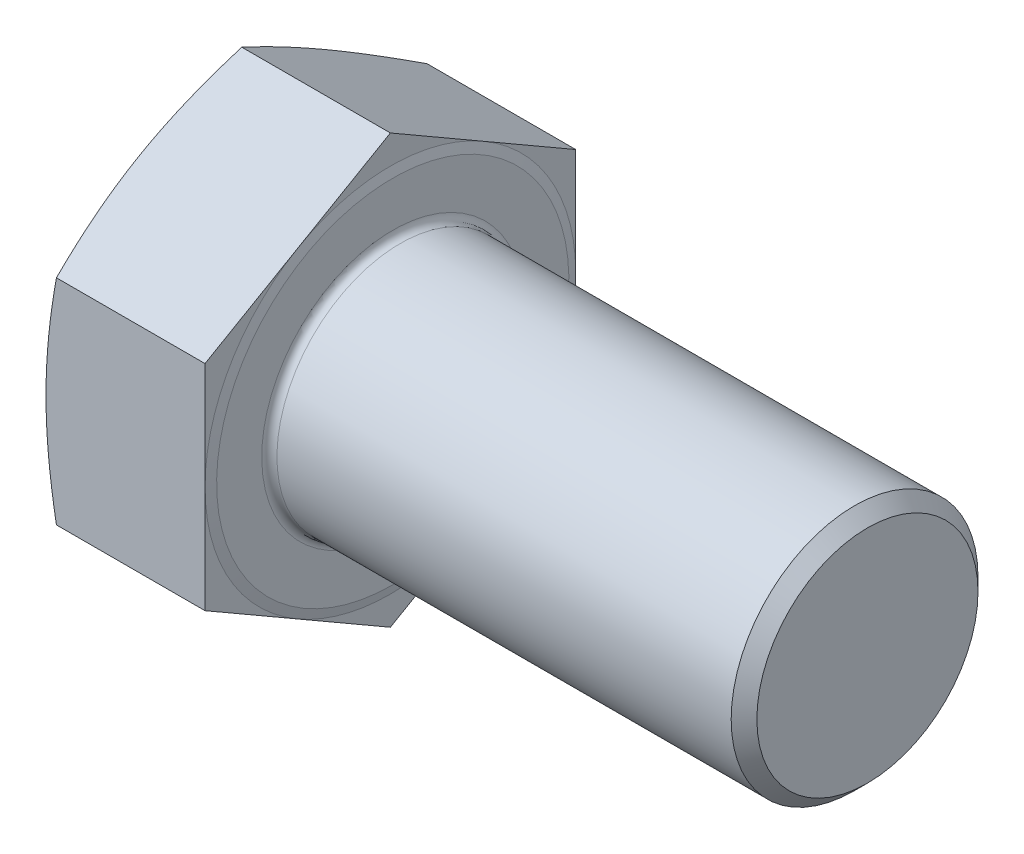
ISO-10303-21;
HEADER;
FILE_DESCRIPTION(('STEP AP214'),'2;1');
FILE_NAME('part.step','',(''),(''),'','','');
FILE_SCHEMA(('AUTOMOTIVE_DESIGN { 1 0 10303 214 1 1 1 1 }'));
ENDSEC;
DATA;
#1=APPLICATION_CONTEXT('core data for automotive mechanical design processes');
#2=APPLICATION_PROTOCOL_DEFINITION('international standard','automotive_design',2000,#1);
#3=PRODUCT_CONTEXT('',#1,'mechanical');
#4=PRODUCT('Part','Part','',(#3));
#5=PRODUCT_RELATED_PRODUCT_CATEGORY('part','',(#4));
#6=PRODUCT_DEFINITION_FORMATION('','',#4);
#7=PRODUCT_DEFINITION_CONTEXT('part definition',#1,'design');
#8=PRODUCT_DEFINITION('design','',#6,#7);
#9=PRODUCT_DEFINITION_SHAPE('','',#8);
#10=(LENGTH_UNIT() NAMED_UNIT(*) SI_UNIT(.MILLI.,.METRE.));
#11=(NAMED_UNIT(*) PLANE_ANGLE_UNIT() SI_UNIT($,.RADIAN.));
#12=(NAMED_UNIT(*) SI_UNIT($,.STERADIAN.) SOLID_ANGLE_UNIT());
#13=UNCERTAINTY_MEASURE_WITH_UNIT(LENGTH_MEASURE(1.E-05),#10,'distance_accuracy_value','');
#14=(GEOMETRIC_REPRESENTATION_CONTEXT(3) GLOBAL_UNCERTAINTY_ASSIGNED_CONTEXT((#13)) GLOBAL_UNIT_ASSIGNED_CONTEXT((#10,
#11,#12)) REPRESENTATION_CONTEXT('',''));
#15=CARTESIAN_POINT('',(0.,0.,0.));
#16=DIRECTION('',(0.,0.,1.));
#17=DIRECTION('',(1.,0.,0.));
#18=AXIS2_PLACEMENT_3D('',#15,#16,#17);
#19=CARTESIAN_POINT('',(34.,0.,0.));
#20=DIRECTION('',(-1.,0.,0.));
#21=DIRECTION('',(0.,-1.,0.));
#22=AXIS2_PLACEMENT_3D('',#19,#20,#21);
#23=PLANE('',#22);
#24=CARTESIAN_POINT('',(34.,0.,0.));
#25=DIRECTION('',(-1.,0.,0.));
#26=DIRECTION('',(0.,-1.,0.));
#27=AXIS2_PLACEMENT_3D('',#24,#25,#26);
#28=CIRCLE('',#27,27.6);
#29=CARTESIAN_POINT('',(34.,-27.6,0.));
#30=VERTEX_POINT('',#29);
#31=EDGE_CURVE('E11',#30,#30,#28,.T.);
#32=ORIENTED_EDGE('',*,*,#31,.T.);
#33=EDGE_LOOP('',(#32));
#34=FACE_BOUND('',#33,.T.);
#35=CARTESIAN_POINT('',(34.,0.,0.));
#36=DIRECTION('',(-1.,0.,0.));
#37=DIRECTION('',(0.,-1.,0.));
#38=AXIS2_PLACEMENT_3D('',#35,#36,#37);
#39=CIRCLE('',#38,37.1);
#40=CARTESIAN_POINT('',(34.,-37.1,0.));
#41=VERTEX_POINT('',#40);
#42=EDGE_CURVE('E140',#41,#41,#39,.T.);
#43=ORIENTED_EDGE('',*,*,#42,.F.);
#44=EDGE_LOOP('',(#43));
#45=FACE_BOUND('',#44,.T.);
#46=ADVANCED_FACE('F32',(#34,#45),#23,.F.);
#47=CARTESIAN_POINT('',(33.5,0.,78.1));
#48=DIRECTION('',(-1.,0.,0.));
#49=DIRECTION('',(0.,0.,1.));
#50=AXIS2_PLACEMENT_3D('',#47,#48,#49);
#51=PLANE('',#50);
#52=DIRECTION('',(0.,-0.5,-0.866025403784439));
#53=VECTOR('',#52,1.);
#54=CARTESIAN_POINT('',(33.5,-22.5455280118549,39.05));
#55=LINE('',#54,#53);
#56=CARTESIAN_POINT('',(33.5,-22.5455280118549,39.05));
#57=VERTEX_POINT('',#56);
#58=CARTESIAN_POINT('',(33.5,-33.8182920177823,19.525));
#59=VERTEX_POINT('',#58);
#60=EDGE_CURVE('E139',#57,#59,#55,.T.);
#61=ORIENTED_EDGE('',*,*,#60,.T.);
#62=CARTESIAN_POINT('',(33.5,0.,0.));
#63=DIRECTION('',(-1.,0.,0.));
#64=DIRECTION('',(0.,-1.,0.));
#65=AXIS2_PLACEMENT_3D('',#62,#63,#64);
#66=CIRCLE('',#65,39.05);
#67=CARTESIAN_POINT('',(33.5,0.,39.05));
#68=VERTEX_POINT('',#67);
#69=EDGE_CURVE('E48',#59,#68,#66,.T.);
#70=ORIENTED_EDGE('',*,*,#69,.T.);
#71=DIRECTION('',(0.,-1.,0.));
#72=VECTOR('',#71,1.);
#73=CARTESIAN_POINT('',(33.5,22.5455280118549,39.05));
#74=LINE('',#73,#72);
#75=EDGE_CURVE('E136',#68,#57,#74,.T.);
#76=ORIENTED_EDGE('',*,*,#75,.T.);
#77=EDGE_LOOP('',(#61,#70,#76));
#78=FACE_BOUND('',#77,.T.);
#79=ADVANCED_FACE('F135',(#78),#51,.F.);
#80=CARTESIAN_POINT('',(33.5,22.5455280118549,39.05));
#81=VERTEX_POINT('',#80);
#82=EDGE_CURVE('E147',#81,#68,#74,.T.);
#83=ORIENTED_EDGE('',*,*,#82,.T.);
#84=CARTESIAN_POINT('',(33.5,33.8182920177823,19.525));
#85=VERTEX_POINT('',#84);
#86=EDGE_CURVE('E122',#68,#85,#66,.T.);
#87=ORIENTED_EDGE('',*,*,#86,.T.);
#88=DIRECTION('',(0.,-0.5,0.866025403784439));
#89=VECTOR('',#88,1.);
#90=CARTESIAN_POINT('',(33.5,45.0910560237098,0.));
#91=LINE('',#90,#89);
#92=EDGE_CURVE('E153',#85,#81,#91,.T.);
#93=ORIENTED_EDGE('',*,*,#92,.T.);
#94=EDGE_LOOP('',(#83,#87,#93));
#95=FACE_BOUND('',#94,.T.);
#96=ADVANCED_FACE('F152',(#95),#51,.F.);
#97=CARTESIAN_POINT('',(33.5,45.0910560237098,0.));
#98=VERTEX_POINT('',#97);
#99=EDGE_CURVE('E150',#98,#85,#91,.T.);
#100=ORIENTED_EDGE('',*,*,#99,.T.);
#101=CARTESIAN_POINT('',(33.5,33.8182920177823,-19.525));
#102=VERTEX_POINT('',#101);
#103=EDGE_CURVE('E126',#85,#102,#66,.T.);
#104=ORIENTED_EDGE('',*,*,#103,.T.);
#105=DIRECTION('',(0.,0.5,0.866025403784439));
#106=VECTOR('',#105,1.);
#107=CARTESIAN_POINT('',(33.5,22.5455280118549,-39.05));
#108=LINE('',#107,#106);
#109=EDGE_CURVE('E309',#102,#98,#108,.T.);
#110=ORIENTED_EDGE('',*,*,#109,.T.);
#111=EDGE_LOOP('',(#100,#104,#110));
#112=FACE_BOUND('',#111,.T.);
#113=ADVANCED_FACE('F298',(#112),#51,.F.);
#114=CARTESIAN_POINT('',(33.5,22.5455280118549,-39.05));
#115=VERTEX_POINT('',#114);
#116=EDGE_CURVE('E312',#115,#102,#108,.T.);
#117=ORIENTED_EDGE('',*,*,#116,.T.);
#118=CARTESIAN_POINT('',(33.5,0.,-39.05));
#119=VERTEX_POINT('',#118);
#120=EDGE_CURVE('E371',#102,#119,#66,.T.);
#121=ORIENTED_EDGE('',*,*,#120,.T.);
#122=DIRECTION('',(0.,1.,0.));
#123=VECTOR('',#122,1.);
#124=CARTESIAN_POINT('',(33.5,-22.5455280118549,-39.05));
#125=LINE('',#124,#123);
#126=EDGE_CURVE('E310',#119,#115,#125,.T.);
#127=ORIENTED_EDGE('',*,*,#126,.T.);
#128=EDGE_LOOP('',(#117,#121,#127));
#129=FACE_BOUND('',#128,.T.);
#130=ADVANCED_FACE('F291',(#129),#51,.F.);
#131=CARTESIAN_POINT('',(33.5,-22.5455280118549,-39.05));
#132=VERTEX_POINT('',#131);
#133=EDGE_CURVE('E303',#132,#119,#125,.T.);
#134=ORIENTED_EDGE('',*,*,#133,.T.);
#135=CARTESIAN_POINT('',(33.5,-33.8182920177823,-19.525));
#136=VERTEX_POINT('',#135);
#137=EDGE_CURVE('E304',#119,#136,#66,.T.);
#138=ORIENTED_EDGE('',*,*,#137,.T.);
#139=DIRECTION('',(0.,0.5,-0.866025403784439));
#140=VECTOR('',#139,1.);
#141=CARTESIAN_POINT('',(33.5,-45.0910560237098,0.));
#142=LINE('',#141,#140);
#143=EDGE_CURVE('E306',#136,#132,#142,.T.);
#144=ORIENTED_EDGE('',*,*,#143,.T.);
#145=EDGE_LOOP('',(#134,#138,#144));
#146=FACE_BOUND('',#145,.T.);
#147=ADVANCED_FACE('F283',(#146),#51,.F.);
#148=CARTESIAN_POINT('',(33.5,-22.5455280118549,39.05));
#149=DIRECTION('',(0.,0.866025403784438,-0.5));
#150=DIRECTION('',(0.,0.5,0.866025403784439));
#151=AXIS2_PLACEMENT_3D('',#148,#149,#150);
#152=PLANE('',#151);
#153=CARTESIAN_POINT('',(2.19880660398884,-45.0911714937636,-0.000199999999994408));
#154=CARTESIAN_POINT('',(2.02887897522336,-44.6242889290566,0.808464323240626));
#155=CARTESIAN_POINT('',(1.86659855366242,-44.1566940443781,1.61836242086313));
#156=CARTESIAN_POINT('',(1.5590027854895,-43.2200682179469,3.24064593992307));
#157=CARTESIAN_POINT('',(1.41368905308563,-42.7510371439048,4.05303159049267));
#158=CARTESIAN_POINT('',(1.14162647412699,-41.8112577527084,5.68077724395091));
#159=CARTESIAN_POINT('',(1.01489188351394,-41.3405083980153,6.49613904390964));
#160=CARTESIAN_POINT('',(0.781802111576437,-40.3977578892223,8.12903082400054));
#161=CARTESIAN_POINT('',(0.6754463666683,-39.9257567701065,8.94656074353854));
#162=CARTESIAN_POINT('',(0.485579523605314,-38.9850975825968,10.5758302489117));
#163=CARTESIAN_POINT('',(0.401862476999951,-38.5164499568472,11.3875517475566));
#164=CARTESIAN_POINT('',(0.257292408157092,-37.5782666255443,13.0125329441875));
#165=CARTESIAN_POINT('',(0.196439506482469,-37.1087309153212,13.8257926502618));
#166=CARTESIAN_POINT('',(0.0986562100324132,-36.1692056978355,15.4530980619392));
#167=CARTESIAN_POINT('',(0.0617170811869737,-35.6992164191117,16.2671433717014));
#168=CARTESIAN_POINT('',(0.0123890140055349,-34.7589154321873,17.8957924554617));
#169=CARTESIAN_POINT('',(0.,-34.2886037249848,18.7103962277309));
#170=CARTESIAN_POINT('',(0.,-33.3479803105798,20.3396037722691));
#171=CARTESIAN_POINT('',(0.0123890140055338,-32.8776686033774,21.1542075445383));
#172=CARTESIAN_POINT('',(0.0617170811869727,-31.9373676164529,22.7828566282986));
#173=CARTESIAN_POINT('',(0.0986562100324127,-31.4673783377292,23.5969019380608));
#174=CARTESIAN_POINT('',(0.196439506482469,-30.5278531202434,25.2242073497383));
#175=CARTESIAN_POINT('',(0.257292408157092,-30.0583174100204,26.0374670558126));
#176=CARTESIAN_POINT('',(0.401862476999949,-29.1201340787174,27.6624482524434));
#177=CARTESIAN_POINT('',(0.48557952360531,-28.6514864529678,28.4741697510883));
#178=CARTESIAN_POINT('',(0.675446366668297,-27.7108272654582,30.1034392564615));
#179=CARTESIAN_POINT('',(0.781802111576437,-27.2388261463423,30.9209691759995));
#180=CARTESIAN_POINT('',(1.01489188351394,-26.2960756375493,32.5538609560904));
#181=CARTESIAN_POINT('',(1.14162647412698,-25.8253262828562,33.3692227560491));
#182=CARTESIAN_POINT('',(1.41368905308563,-24.8855468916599,34.9969684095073));
#183=CARTESIAN_POINT('',(1.55900278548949,-24.4165158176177,35.8093540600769));
#184=CARTESIAN_POINT('',(1.86659855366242,-23.4798899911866,37.4316375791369));
#185=CARTESIAN_POINT('',(2.02887897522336,-23.012295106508,38.2415356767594));
#186=CARTESIAN_POINT('',(2.19880660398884,-22.545412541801,39.0502));
#187=B_SPLINE_CURVE_WITH_KNOTS('',3,(#153,#154,#155,#156,#157,#158,#159,#160,#161,#162,#163,
#164,#165,#166,#167,#168,#169,#170,#171,#172,#173,#174,#175,#176,#177,#178,#179,#180,#181,#182,
#183,#184,#185,#186),.UNSPECIFIED.,.F.,.F.,(4,2,2,2,2,2,2,2,2,2,2,2,2,2,2,2,4),(0.,
2.8473194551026,5.69490958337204,8.54467338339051,11.3943583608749,14.2171733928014,
17.040003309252,19.8618016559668,22.6835913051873,25.5053809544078,28.3271793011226,
31.1500092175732,33.9728242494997,36.8225092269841,39.6722730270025,42.519863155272,
45.3671826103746),.UNSPECIFIED.);
#188=CARTESIAN_POINT('',(2.19876457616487,-45.0910560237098,0.));
#189=VERTEX_POINT('',#188);
#190=CARTESIAN_POINT('',(0.,-33.8182920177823,19.525));
#191=VERTEX_POINT('',#190);
#192=EDGE_CURVE('E352',#189,#191,#187,.T.);
#193=ORIENTED_EDGE('',*,*,#192,.F.);
#194=DIRECTION('',(-1.,0.,0.));
#195=VECTOR('',#194,1.);
#196=CARTESIAN_POINT('',(33.5,-45.0910560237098,0.));
#197=LINE('',#196,#195);
#198=CARTESIAN_POINT('',(33.5,-45.0910560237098,0.));
#199=VERTEX_POINT('',#198);
#200=EDGE_CURVE('E170',#199,#189,#197,.T.);
#201=ORIENTED_EDGE('',*,*,#200,.F.);
#202=EDGE_CURVE('E360',#59,#199,#55,.T.);
#203=ORIENTED_EDGE('',*,*,#202,.F.);
#204=ORIENTED_EDGE('',*,*,#60,.F.);
#205=DIRECTION('',(-1.,0.,0.));
#206=VECTOR('',#205,1.);
#207=CARTESIAN_POINT('',(33.5,-22.5455280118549,39.05));
#208=LINE('',#207,#206);
#209=CARTESIAN_POINT('',(2.19876457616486,-22.5455280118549,39.05));
#210=VERTEX_POINT('',#209);
#211=EDGE_CURVE('E149',#57,#210,#208,.T.);
#212=ORIENTED_EDGE('',*,*,#211,.T.);
#213=EDGE_CURVE('E240',#191,#210,#187,.T.);
#214=ORIENTED_EDGE('',*,*,#213,.F.);
#215=EDGE_LOOP('',(#193,#201,#203,#204,#212,#214));
#216=FACE_BOUND('',#215,.T.);
#217=ADVANCED_FACE('F34',(#216),#152,.F.);
#218=CARTESIAN_POINT('',(33.5,-45.0910560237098,0.));
#219=DIRECTION('',(0.,0.866025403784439,0.5));
#220=DIRECTION('',(0.,-0.5,0.866025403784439));
#221=AXIS2_PLACEMENT_3D('',#218,#219,#220);
#222=PLANE('',#221);
#223=CARTESIAN_POINT('',(2.19880660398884,-22.5454125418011,-39.0502));
#224=CARTESIAN_POINT('',(2.02887897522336,-23.0122951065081,-38.2415356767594));
#225=CARTESIAN_POINT('',(1.86659855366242,-23.4798899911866,-37.4316375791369));
#226=CARTESIAN_POINT('',(1.55900278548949,-24.4165158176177,-35.8093540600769));
#227=CARTESIAN_POINT('',(1.41368905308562,-24.8855468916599,-34.9969684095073));
#228=CARTESIAN_POINT('',(1.14162647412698,-25.8253262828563,-33.3692227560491));
#229=CARTESIAN_POINT('',(1.01489188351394,-26.2960756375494,-32.5538609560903));
#230=CARTESIAN_POINT('',(0.781802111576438,-27.2388261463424,-30.9209691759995));
#231=CARTESIAN_POINT('',(0.675446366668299,-27.7108272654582,-30.1034392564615));
#232=CARTESIAN_POINT('',(0.485579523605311,-28.6514864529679,-28.4741697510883));
#233=CARTESIAN_POINT('',(0.40186247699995,-29.1201340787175,-27.6624482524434));
#234=CARTESIAN_POINT('',(0.257292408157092,-30.0583174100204,-26.0374670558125));
#235=CARTESIAN_POINT('',(0.196439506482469,-30.5278531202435,-25.2242073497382));
#236=CARTESIAN_POINT('',(0.0986562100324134,-31.4673783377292,-23.5969019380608));
#237=CARTESIAN_POINT('',(0.0617170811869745,-31.9373676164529,-22.7828566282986));
#238=CARTESIAN_POINT('',(0.0123890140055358,-32.8776686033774,-21.1542075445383));
#239=CARTESIAN_POINT('',(0.,-33.3479803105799,-20.3396037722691));
#240=CARTESIAN_POINT('',(0.,-34.2886037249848,-18.7103962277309));
#241=CARTESIAN_POINT('',(0.0123890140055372,-34.7589154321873,-17.8957924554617));
#242=CARTESIAN_POINT('',(0.0617170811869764,-35.6992164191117,-16.2671433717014));
#243=CARTESIAN_POINT('',(0.0986562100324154,-36.1692056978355,-15.4530980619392));
#244=CARTESIAN_POINT('',(0.196439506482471,-37.1087309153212,-13.8257926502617));
#245=CARTESIAN_POINT('',(0.257292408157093,-37.5782666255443,-13.0125329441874));
#246=CARTESIAN_POINT('',(0.401862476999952,-38.5164499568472,-11.3875517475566));
#247=CARTESIAN_POINT('',(0.485579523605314,-38.9850975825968,-10.5758302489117));
#248=CARTESIAN_POINT('',(0.675446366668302,-39.9257567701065,-8.94656074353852));
#249=CARTESIAN_POINT('',(0.78180211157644,-40.3977578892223,-8.12903082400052));
#250=CARTESIAN_POINT('',(1.01489188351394,-41.3405083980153,-6.49613904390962));
#251=CARTESIAN_POINT('',(1.14162647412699,-41.8112577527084,-5.6807772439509));
#252=CARTESIAN_POINT('',(1.41368905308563,-42.7510371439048,-4.05303159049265));
#253=CARTESIAN_POINT('',(1.5590027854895,-43.2200682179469,-3.24064593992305));
#254=CARTESIAN_POINT('',(1.86659855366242,-44.1566940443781,-1.61836242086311));
#255=CARTESIAN_POINT('',(2.02887897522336,-44.6242889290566,-0.808464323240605));
#256=CARTESIAN_POINT('',(2.19880660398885,-45.0911714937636,0.000200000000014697));
#257=B_SPLINE_CURVE_WITH_KNOTS('',3,(#223,#224,#225,#226,#227,#228,#229,#230,#231,#232,#233,
#234,#235,#236,#237,#238,#239,#240,#241,#242,#243,#244,#245,#246,#247,#248,#249,#250,#251,#252,
#253,#254,#255,#256),.UNSPECIFIED.,.F.,.F.,(4,2,2,2,2,2,2,2,2,2,2,2,2,2,2,2,4),(0.,
2.8473194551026,5.69490958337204,8.54467338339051,11.3943583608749,14.2171733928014,
17.040003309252,19.8618016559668,22.6835913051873,25.5053809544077,28.3271793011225,
31.1500092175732,33.9728242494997,36.822509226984,39.6722730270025,42.519863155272,
45.3671826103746),.UNSPECIFIED.);
#258=CARTESIAN_POINT('',(2.19876457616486,-22.5455280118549,-39.05));
#259=VERTEX_POINT('',#258);
#260=CARTESIAN_POINT('',(0.,-33.8182920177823,-19.525));
#261=VERTEX_POINT('',#260);
#262=EDGE_CURVE('E255',#259,#261,#257,.T.);
#263=ORIENTED_EDGE('',*,*,#262,.F.);
#264=DIRECTION('',(-1.,0.,0.));
#265=VECTOR('',#264,1.);
#266=CARTESIAN_POINT('',(33.5,-22.5455280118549,-39.05));
#267=LINE('',#266,#265);
#268=EDGE_CURVE('E167',#132,#259,#267,.T.);
#269=ORIENTED_EDGE('',*,*,#268,.F.);
#270=ORIENTED_EDGE('',*,*,#143,.F.);
#271=EDGE_CURVE('E313',#199,#136,#142,.T.);
#272=ORIENTED_EDGE('',*,*,#271,.F.);
#273=ORIENTED_EDGE('',*,*,#200,.T.);
#274=EDGE_CURVE('E251',#261,#189,#257,.T.);
#275=ORIENTED_EDGE('',*,*,#274,.F.);
#276=EDGE_LOOP('',(#263,#269,#270,#272,#273,#275));
#277=FACE_BOUND('',#276,.T.);
#278=ADVANCED_FACE('F262',(#277),#222,.F.);
#279=CARTESIAN_POINT('',(33.5,-22.5455280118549,-39.05));
#280=DIRECTION('',(0.,0.,1.));
#281=DIRECTION('',(1.,0.,0.));
#282=AXIS2_PLACEMENT_3D('',#279,#280,#281);
#283=PLANE('',#282);
#284=CARTESIAN_POINT('',(11.7493259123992,-59.6926306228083,-39.05));
#285=CARTESIAN_POINT('',(11.4802734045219,-58.809262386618,-39.05));
#286=CARTESIAN_POINT('',(11.2128440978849,-57.9253982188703,-39.05));
#287=CARTESIAN_POINT('',(10.6816039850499,-56.1565777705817,-39.05));
#288=CARTESIAN_POINT('',(10.4177931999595,-55.2716214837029,-39.05));
#289=CARTESIAN_POINT('',(9.89414501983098,-53.5004580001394,-39.05));
#290=CARTESIAN_POINT('',(9.63430793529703,-52.614250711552,-39.05));
#291=CARTESIAN_POINT('',(9.11906909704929,-50.8405500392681,-39.05));
#292=CARTESIAN_POINT('',(8.86366733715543,-49.9530566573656,-39.05));
#293=CARTESIAN_POINT('',(8.10388292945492,-47.2851582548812,-39.05));
#294=CARTESIAN_POINT('',(7.60690041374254,-45.5026344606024,-39.05));
#295=CARTESIAN_POINT('',(6.63738312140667,-41.9309626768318,-39.05));
#296=CARTESIAN_POINT('',(6.16484790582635,-40.1418148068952,-39.05));
#297=CARTESIAN_POINT('',(5.25593806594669,-36.5778026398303,-39.05));
#298=CARTESIAN_POINT('',(4.81918943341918,-34.8030342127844,-39.05));
#299=CARTESIAN_POINT('',(3.98287501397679,-31.2446675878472,-39.05));
#300=CARTESIAN_POINT('',(3.58330985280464,-29.4610692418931,-39.05));
#301=CARTESIAN_POINT('',(2.83067996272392,-25.8846372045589,-39.05));
#302=CARTESIAN_POINT('',(2.4775993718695,-24.0918068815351,-39.05));
#303=CARTESIAN_POINT('',(1.82868609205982,-20.4957550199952,-39.05));
#304=CARTESIAN_POINT('',(1.53285148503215,-18.6925338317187,-39.05));
#305=CARTESIAN_POINT('',(1.03975259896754,-15.2786715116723,-39.05));
#306=CARTESIAN_POINT('',(0.835155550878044,-13.6691062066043,-39.05));
#307=CARTESIAN_POINT('',(0.575376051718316,-11.249740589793,-39.05));
#308=CARTESIAN_POINT('',(0.496634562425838,-10.4424344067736,-39.05));
#309=CARTESIAN_POINT('',(0.355742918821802,-8.8263830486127,-39.05));
#310=CARTESIAN_POINT('',(0.293592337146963,-8.0176379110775,-39.05));
#311=CARTESIAN_POINT('',(0.186685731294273,-6.39955399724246,-39.05));
#312=CARTESIAN_POINT('',(0.141917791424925,-5.5902160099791,-39.05));
#313=CARTESIAN_POINT('',(0.070294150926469,-3.97074455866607,-39.05));
#314=CARTESIAN_POINT('',(0.043438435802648,-3.16061109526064,-39.05));
#315=CARTESIAN_POINT('',(0.00800035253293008,-1.53994595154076,-39.05));
#316=CARTESIAN_POINT('',(-0.00058208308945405,-0.729414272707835,-39.05));
#317=CARTESIAN_POINT('',(0.00064340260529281,0.891635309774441,-39.05));
#318=CARTESIAN_POINT('',(0.0104513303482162,1.70215321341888,-39.05));
#319=CARTESIAN_POINT('',(0.0484197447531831,3.32686781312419,-39.05));
#320=CARTESIAN_POINT('',(0.0766729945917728,4.14106233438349,-39.05));
#321=CARTESIAN_POINT('',(0.151238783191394,5.76862006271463,-39.05));
#322=CARTESIAN_POINT('',(0.197551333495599,6.58198326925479,-39.05));
#323=CARTESIAN_POINT('',(0.307633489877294,8.20752597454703,-39.05));
#324=CARTESIAN_POINT('',(0.37140310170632,9.01970547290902,-39.05));
#325=CARTESIAN_POINT('',(0.515609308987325,10.6425901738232,-39.05));
#326=CARTESIAN_POINT('',(0.596046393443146,11.4532953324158,-39.05));
#327=CARTESIAN_POINT('',(0.861142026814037,13.8841730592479,-39.05));
#328=CARTESIAN_POINT('',(1.06949487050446,15.5018176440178,-39.05));
#329=CARTESIAN_POINT('',(1.42310454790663,17.9220965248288,-39.05));
#330=CARTESIAN_POINT('',(1.54782354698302,18.7278379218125,-39.05));
#331=CARTESIAN_POINT('',(1.80988051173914,20.3372790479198,-39.05));
#332=CARTESIAN_POINT('',(1.94721856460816,21.1409787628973,-39.05));
#333=CARTESIAN_POINT('',(2.39170088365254,23.6338557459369,-39.05));
#334=CARTESIAN_POINT('',(2.71869181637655,25.3195088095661,-39.05));
#335=CARTESIAN_POINT('',(3.41475154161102,28.6821282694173,-39.05));
#336=CARTESIAN_POINT('',(3.78382350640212,30.3590940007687,-39.05));
#337=CARTESIAN_POINT('',(4.55630449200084,33.7055725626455,-39.05));
#338=CARTESIAN_POINT('',(4.95972348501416,35.3750830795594,-39.05));
#339=CARTESIAN_POINT('',(5.79433369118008,38.7070690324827,-39.05));
#340=CARTESIAN_POINT('',(6.2255242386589,40.3695446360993,-39.05));
#341=CARTESIAN_POINT('',(7.11105522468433,43.6905844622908,-39.05));
#342=CARTESIAN_POINT('',(7.56542468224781,45.3491409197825,-39.05));
#343=CARTESIAN_POINT('',(8.49264683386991,48.6610719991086,-39.05));
#344=CARTESIAN_POINT('',(8.96549960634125,50.3144465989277,-39.05));
#345=CARTESIAN_POINT('',(9.92630538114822,53.6164920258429,-39.05));
#346=CARTESIAN_POINT('',(10.4142558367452,55.2651635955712,-39.05));
#347=CARTESIAN_POINT('',(11.4027093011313,58.5587293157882,-39.05));
#348=CARTESIAN_POINT('',(11.9032122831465,60.2036234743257,-39.05));
#349=CARTESIAN_POINT('',(12.9090964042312,63.4720449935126,-39.05));
#350=CARTESIAN_POINT('',(13.41436267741,65.0956077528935,-39.05));
#351=CARTESIAN_POINT('',(14.4335020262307,68.3400271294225,-39.05));
#352=CARTESIAN_POINT('',(14.9473751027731,69.9608837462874,-39.05));
#353=CARTESIAN_POINT('',(15.9824354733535,73.2003398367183,-39.05));
#354=CARTESIAN_POINT('',(16.5036231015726,74.8189392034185,-39.05));
#355=CARTESIAN_POINT('',(17.5522174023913,78.0541225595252,-39.05));
#356=CARTESIAN_POINT('',(18.079624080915,79.6707065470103,-39.05));
#357=CARTESIAN_POINT('',(19.1377632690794,82.8959891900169,-39.05));
#358=CARTESIAN_POINT('',(19.668475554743,84.5046944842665,-39.05));
#359=CARTESIAN_POINT('',(20.7344797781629,87.7205873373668,-39.05));
#360=CARTESIAN_POINT('',(21.2697717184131,89.3277748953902,-39.05));
#361=CARTESIAN_POINT('',(22.3442876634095,92.540688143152,-39.05));
#362=CARTESIAN_POINT('',(22.8835113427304,94.1464139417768,-39.05));
#363=CARTESIAN_POINT('',(23.9654478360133,97.3566854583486,-39.05));
#364=CARTESIAN_POINT('',(24.5081606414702,98.9612311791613,-39.05));
#365=CARTESIAN_POINT('',(25.052376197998,100.565265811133,-39.05));
#366=B_SPLINE_CURVE_WITH_KNOTS('',3,(#284,#285,#286,#287,#288,#289,#290,#291,#292,#293,#294,
#295,#296,#297,#298,#299,#300,#301,#302,#303,#304,#305,#306,#307,#308,#309,#310,#311,#312,#313,
#314,#315,#316,#317,#318,#319,#320,#321,#322,#323,#324,#325,#326,#327,#328,#329,#330,#331,#332,
#333,#334,#335,#336,#337,#338,#339,#340,#341,#342,#343,#344,#345,#346,#347,#348,#349,#350,#351,
#352,#353,#354,#355,#356,#357,#358,#359,#360,#361,#362,#363,#364,#365),.UNSPECIFIED.,.F.,.F.,(4,
2,2,2,2,2,2,2,2,2,2,2,2,2,2,2,2,2,2,2,2,2,2,2,2,2,2,2,2,2,2,2,2,2,2,2,2,2,2,2,4),(0.,
2.77029982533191,5.5406158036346,8.31114715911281,11.0816746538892,16.6330543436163,
22.1843343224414,27.6671699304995,33.150097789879,38.631149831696,44.1120181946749,
48.9783767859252,51.4116444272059,53.8448493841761,56.276383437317,58.7079155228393,
61.139438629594,63.5709625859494,66.0148100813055,68.4586591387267,70.9025090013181,
73.3464305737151,78.2381511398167,80.6840912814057,83.1300483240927,88.2805427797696,
93.4314257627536,98.5838093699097,103.736069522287,108.894946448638,114.053845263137,
119.211878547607,124.369900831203,129.470975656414,134.572051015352,139.673360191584,
144.774674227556,149.856624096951,154.938576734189,160.020113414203,165.101637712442),.UNSPECIFIED.);
#367=CARTESIAN_POINT('',(2.19876457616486,22.5455280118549,-39.05));
#368=VERTEX_POINT('',#367);
#369=CARTESIAN_POINT('',(0.,0.,-39.05));
#370=VERTEX_POINT('',#369);
#371=EDGE_CURVE('E361',#368,#370,#366,.F.);
#372=ORIENTED_EDGE('',*,*,#371,.F.);
#373=DIRECTION('',(-1.,0.,0.));
#374=VECTOR('',#373,1.);
#375=CARTESIAN_POINT('',(33.5,22.5455280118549,-39.05));
#376=LINE('',#375,#374);
#377=EDGE_CURVE('E164',#115,#368,#376,.T.);
#378=ORIENTED_EDGE('',*,*,#377,.F.);
#379=ORIENTED_EDGE('',*,*,#126,.F.);
#380=ORIENTED_EDGE('',*,*,#133,.F.);
#381=ORIENTED_EDGE('',*,*,#268,.T.);
#382=EDGE_CURVE('E256',#370,#259,#366,.F.);
#383=ORIENTED_EDGE('',*,*,#382,.F.);
#384=EDGE_LOOP('',(#372,#378,#379,#380,#381,#383));
#385=FACE_BOUND('',#384,.T.);
#386=ADVANCED_FACE('F265',(#385),#283,.F.);
#387=CARTESIAN_POINT('',(33.5,22.5455280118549,-39.05));
#388=DIRECTION('',(0.,-0.866025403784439,0.5));
#389=DIRECTION('',(0.,-0.5,-0.866025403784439));
#390=AXIS2_PLACEMENT_3D('',#387,#388,#389);
#391=PLANE('',#390);
#392=CARTESIAN_POINT('',(2.19880660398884,45.0911714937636,0.000199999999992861));
#393=CARTESIAN_POINT('',(2.02887897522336,44.6242889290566,-0.808464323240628));
#394=CARTESIAN_POINT('',(1.86659855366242,44.1566940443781,-1.61836242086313));
#395=CARTESIAN_POINT('',(1.55900278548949,43.2200682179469,-3.24064593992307));
#396=CARTESIAN_POINT('',(1.41368905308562,42.7510371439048,-4.05303159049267));
#397=CARTESIAN_POINT('',(1.14162647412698,41.8112577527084,-5.68077724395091));
#398=CARTESIAN_POINT('',(1.01489188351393,41.3405083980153,-6.49613904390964));
#399=CARTESIAN_POINT('',(0.781802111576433,40.3977578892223,-8.12903082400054));
#400=CARTESIAN_POINT('',(0.675446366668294,39.9257567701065,-8.94656074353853));
#401=CARTESIAN_POINT('',(0.485579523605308,38.9850975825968,-10.5758302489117));
#402=CARTESIAN_POINT('',(0.401862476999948,38.5164499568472,-11.3875517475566));
#403=CARTESIAN_POINT('',(0.257292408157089,37.5782666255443,-13.0125329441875));
#404=CARTESIAN_POINT('',(0.196439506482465,37.1087309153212,-13.8257926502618));
#405=CARTESIAN_POINT('',(0.0986562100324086,36.1692056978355,-15.4530980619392));
#406=CARTESIAN_POINT('',(0.0617170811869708,35.6992164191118,-16.2671433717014));
#407=CARTESIAN_POINT('',(0.0123890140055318,34.7589154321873,-17.8957924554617));
#408=CARTESIAN_POINT('',(0.,34.2886037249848,-18.7103962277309));
#409=CARTESIAN_POINT('',(0.,33.3479803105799,-20.3396037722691));
#410=CARTESIAN_POINT('',(0.0123890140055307,32.8776686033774,-21.1542075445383));
#411=CARTESIAN_POINT('',(0.0617170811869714,31.9373676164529,-22.7828566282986));
#412=CARTESIAN_POINT('',(0.0986562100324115,31.4673783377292,-23.5969019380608));
#413=CARTESIAN_POINT('',(0.196439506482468,30.5278531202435,-25.2242073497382));
#414=CARTESIAN_POINT('',(0.257292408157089,30.0583174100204,-26.0374670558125));
#415=CARTESIAN_POINT('',(0.401862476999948,29.1201340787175,-27.6624482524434));
#416=CARTESIAN_POINT('',(0.48557952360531,28.6514864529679,-28.4741697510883));
#417=CARTESIAN_POINT('',(0.675446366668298,27.7108272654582,-30.1034392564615));
#418=CARTESIAN_POINT('',(0.781802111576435,27.2388261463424,-30.9209691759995));
#419=CARTESIAN_POINT('',(1.01489188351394,26.2960756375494,-32.5538609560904));
#420=CARTESIAN_POINT('',(1.14162647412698,25.8253262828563,-33.3692227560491));
#421=CARTESIAN_POINT('',(1.41368905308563,24.8855468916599,-34.9969684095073));
#422=CARTESIAN_POINT('',(1.55900278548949,24.4165158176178,-35.8093540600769));
#423=CARTESIAN_POINT('',(1.86659855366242,23.4798899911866,-37.4316375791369));
#424=CARTESIAN_POINT('',(2.02887897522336,23.0122951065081,-38.2415356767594));
#425=CARTESIAN_POINT('',(2.19880660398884,22.5454125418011,-39.0502));
#426=B_SPLINE_CURVE_WITH_KNOTS('',3,(#392,#393,#394,#395,#396,#397,#398,#399,#400,#401,#402,
#403,#404,#405,#406,#407,#408,#409,#410,#411,#412,#413,#414,#415,#416,#417,#418,#419,#420,#421,
#422,#423,#424,#425),.UNSPECIFIED.,.F.,.F.,(4,2,2,2,2,2,2,2,2,2,2,2,2,2,2,2,4),(0.,
2.8473194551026,5.69490958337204,8.54467338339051,11.3943583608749,14.2171733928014,
17.040003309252,19.8618016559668,22.6835913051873,25.5053809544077,28.3271793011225,
31.1500092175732,33.9728242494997,36.822509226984,39.6722730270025,42.519863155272,
45.3671826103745),.UNSPECIFIED.);
#427=CARTESIAN_POINT('',(2.19876457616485,45.0910560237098,0.));
#428=VERTEX_POINT('',#427);
#429=CARTESIAN_POINT('',(0.,33.8182920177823,-19.525));
#430=VERTEX_POINT('',#429);
#431=EDGE_CURVE('E245',#428,#430,#426,.T.);
#432=ORIENTED_EDGE('',*,*,#431,.F.);
#433=DIRECTION('',(-1.,0.,0.));
#434=VECTOR('',#433,1.);
#435=CARTESIAN_POINT('',(33.5,45.0910560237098,0.));
#436=LINE('',#435,#434);
#437=EDGE_CURVE('E161',#98,#428,#436,.T.);
#438=ORIENTED_EDGE('',*,*,#437,.F.);
#439=ORIENTED_EDGE('',*,*,#109,.F.);
#440=ORIENTED_EDGE('',*,*,#116,.F.);
#441=ORIENTED_EDGE('',*,*,#377,.T.);
#442=EDGE_CURVE('E353',#430,#368,#426,.T.);
#443=ORIENTED_EDGE('',*,*,#442,.F.);
#444=EDGE_LOOP('',(#432,#438,#439,#440,#441,#443));
#445=FACE_BOUND('',#444,.T.);
#446=ADVANCED_FACE('F269',(#445),#391,.F.);
#447=CARTESIAN_POINT('',(33.5,45.0910560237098,0.));
#448=DIRECTION('',(0.,-0.866025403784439,-0.5));
#449=DIRECTION('',(0.,0.5,-0.866025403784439));
#450=AXIS2_PLACEMENT_3D('',#447,#448,#449);
#451=PLANE('',#450);
#452=CARTESIAN_POINT('',(2.19880660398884,22.5454125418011,39.0502));
#453=CARTESIAN_POINT('',(2.02887897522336,23.0122951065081,38.2415356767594));
#454=CARTESIAN_POINT('',(1.86659855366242,23.4798899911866,37.4316375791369));
#455=CARTESIAN_POINT('',(1.55900278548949,24.4165158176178,35.8093540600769));
#456=CARTESIAN_POINT('',(1.41368905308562,24.8855468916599,34.9969684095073));
#457=CARTESIAN_POINT('',(1.14162647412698,25.8253262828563,33.3692227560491));
#458=CARTESIAN_POINT('',(1.01489188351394,26.2960756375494,32.5538609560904));
#459=CARTESIAN_POINT('',(0.781802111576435,27.2388261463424,30.9209691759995));
#460=CARTESIAN_POINT('',(0.675446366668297,27.7108272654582,30.1034392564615));
#461=CARTESIAN_POINT('',(0.485579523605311,28.6514864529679,28.4741697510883));
#462=CARTESIAN_POINT('',(0.401862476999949,29.1201340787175,27.6624482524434));
#463=CARTESIAN_POINT('',(0.25729240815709,30.0583174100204,26.0374670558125));
#464=CARTESIAN_POINT('',(0.196439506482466,30.5278531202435,25.2242073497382));
#465=CARTESIAN_POINT('',(0.098656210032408,31.4673783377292,23.5969019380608));
#466=CARTESIAN_POINT('',(0.0617170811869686,31.9373676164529,22.7828566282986));
#467=CARTESIAN_POINT('',(0.0123890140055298,32.8776686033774,21.1542075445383));
#468=CARTESIAN_POINT('',(0.,33.3479803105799,20.3396037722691));
#469=CARTESIAN_POINT('',(0.,34.2886037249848,18.7103962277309));
#470=CARTESIAN_POINT('',(0.0123890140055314,34.7589154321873,17.8957924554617));
#471=CARTESIAN_POINT('',(0.0617170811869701,35.6992164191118,16.2671433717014));
#472=CARTESIAN_POINT('',(0.0986562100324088,36.1692056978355,15.4530980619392));
#473=CARTESIAN_POINT('',(0.196439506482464,37.1087309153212,13.8257926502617));
#474=CARTESIAN_POINT('',(0.257292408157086,37.5782666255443,13.0125329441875));
#475=CARTESIAN_POINT('',(0.401862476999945,38.5164499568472,11.3875517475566));
#476=CARTESIAN_POINT('',(0.485579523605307,38.9850975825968,10.5758302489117));
#477=CARTESIAN_POINT('',(0.675446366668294,39.9257567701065,8.94656074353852));
#478=CARTESIAN_POINT('',(0.781802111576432,40.3977578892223,8.12903082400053));
#479=CARTESIAN_POINT('',(1.01489188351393,41.3405083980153,6.49613904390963));
#480=CARTESIAN_POINT('',(1.14162647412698,41.8112577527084,5.68077724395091));
#481=CARTESIAN_POINT('',(1.41368905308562,42.7510371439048,4.05303159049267));
#482=CARTESIAN_POINT('',(1.55900278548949,43.2200682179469,3.24064593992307));
#483=CARTESIAN_POINT('',(1.86659855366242,44.1566940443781,1.61836242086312));
#484=CARTESIAN_POINT('',(2.02887897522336,44.6242889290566,0.808464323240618));
#485=CARTESIAN_POINT('',(2.19880660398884,45.0911714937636,-0.000200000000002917));
#486=B_SPLINE_CURVE_WITH_KNOTS('',3,(#452,#453,#454,#455,#456,#457,#458,#459,#460,#461,#462,
#463,#464,#465,#466,#467,#468,#469,#470,#471,#472,#473,#474,#475,#476,#477,#478,#479,#480,#481,
#482,#483,#484,#485),.UNSPECIFIED.,.F.,.F.,(4,2,2,2,2,2,2,2,2,2,2,2,2,2,2,2,4),(0.,
2.8473194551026,5.69490958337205,8.54467338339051,11.3943583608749,14.2171733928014,
17.040003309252,19.8618016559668,22.6835913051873,25.5053809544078,28.3271793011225,
31.1500092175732,33.9728242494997,36.822509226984,39.6722730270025,42.519863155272,
45.3671826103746),.UNSPECIFIED.);
#487=CARTESIAN_POINT('',(2.19876457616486,22.5455280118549,39.05));
#488=VERTEX_POINT('',#487);
#489=CARTESIAN_POINT('',(0.,33.8182920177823,19.525));
#490=VERTEX_POINT('',#489);
#491=EDGE_CURVE('E233',#488,#490,#486,.T.);
#492=ORIENTED_EDGE('',*,*,#491,.F.);
#493=DIRECTION('',(-1.,0.,0.));
#494=VECTOR('',#493,1.);
#495=CARTESIAN_POINT('',(33.5,22.5455280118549,39.05));
#496=LINE('',#495,#494);
#497=EDGE_CURVE('E155',#81,#488,#496,.T.);
#498=ORIENTED_EDGE('',*,*,#497,.F.);
#499=ORIENTED_EDGE('',*,*,#92,.F.);
#500=ORIENTED_EDGE('',*,*,#99,.F.);
#501=ORIENTED_EDGE('',*,*,#437,.T.);
#502=EDGE_CURVE('E345',#490,#428,#486,.T.);
#503=ORIENTED_EDGE('',*,*,#502,.F.);
#504=EDGE_LOOP('',(#492,#498,#499,#500,#501,#503));
#505=FACE_BOUND('',#504,.T.);
#506=ADVANCED_FACE('F273',(#505),#451,.F.);
#507=CARTESIAN_POINT('',(33.5,22.5455280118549,39.05));
#508=DIRECTION('',(0.,0.,-1.));
#509=DIRECTION('',(-1.,0.,0.));
#510=AXIS2_PLACEMENT_3D('',#507,#508,#509);
#511=PLANE('',#510);
#512=CARTESIAN_POINT('',(11.7493259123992,-59.6926306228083,39.05));
#513=CARTESIAN_POINT('',(11.4802734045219,-58.809262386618,39.05));
#514=CARTESIAN_POINT('',(11.2128440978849,-57.9253982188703,39.05));
#515=CARTESIAN_POINT('',(10.6816039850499,-56.1565777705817,39.05));
#516=CARTESIAN_POINT('',(10.4177931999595,-55.2716214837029,39.05));
#517=CARTESIAN_POINT('',(9.89414501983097,-53.5004580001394,39.05));
#518=CARTESIAN_POINT('',(9.63430793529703,-52.614250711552,39.05));
#519=CARTESIAN_POINT('',(9.11906909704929,-50.8405500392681,39.05));
#520=CARTESIAN_POINT('',(8.86366733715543,-49.9530566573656,39.05));
#521=CARTESIAN_POINT('',(8.10388292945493,-47.2851582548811,39.05));
#522=CARTESIAN_POINT('',(7.60690041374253,-45.5026344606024,39.05));
#523=CARTESIAN_POINT('',(6.63738312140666,-41.9309626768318,39.05));
#524=CARTESIAN_POINT('',(6.16484790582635,-40.1418148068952,39.05));
#525=CARTESIAN_POINT('',(5.25593806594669,-36.5778026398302,39.05));
#526=CARTESIAN_POINT('',(4.81918943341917,-34.8030342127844,39.05));
#527=CARTESIAN_POINT('',(3.98287501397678,-31.2446675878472,39.05));
#528=CARTESIAN_POINT('',(3.58330985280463,-29.4610692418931,39.05));
#529=CARTESIAN_POINT('',(2.83067996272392,-25.8846372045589,39.05));
#530=CARTESIAN_POINT('',(2.47759937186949,-24.0918068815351,39.05));
#531=CARTESIAN_POINT('',(1.82868609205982,-20.4957550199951,39.05));
#532=CARTESIAN_POINT('',(1.53285148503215,-18.6925338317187,39.05));
#533=CARTESIAN_POINT('',(1.03975259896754,-15.2786715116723,39.05));
#534=CARTESIAN_POINT('',(0.835155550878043,-13.6691062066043,39.05));
#535=CARTESIAN_POINT('',(0.575376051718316,-11.249740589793,39.05));
#536=CARTESIAN_POINT('',(0.496634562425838,-10.4424344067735,39.05));
#537=CARTESIAN_POINT('',(0.355742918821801,-8.82638304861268,39.05));
#538=CARTESIAN_POINT('',(0.293592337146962,-8.01763791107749,39.05));
#539=CARTESIAN_POINT('',(0.186685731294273,-6.39955399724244,39.05));
#540=CARTESIAN_POINT('',(0.141917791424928,-5.59021600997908,39.05));
#541=CARTESIAN_POINT('',(0.0702941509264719,-3.97074455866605,39.05));
#542=CARTESIAN_POINT('',(0.04343843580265,-3.16061109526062,39.05));
#543=CARTESIAN_POINT('',(0.00800035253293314,-1.53994595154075,39.05));
#544=CARTESIAN_POINT('',(-0.000582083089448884,-0.729414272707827,39.05));
#545=CARTESIAN_POINT('',(0.000643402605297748,0.891635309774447,39.05));
#546=CARTESIAN_POINT('',(0.0104513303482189,1.70215321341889,39.05));
#547=CARTESIAN_POINT('',(0.0484197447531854,3.3268678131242,39.05));
#548=CARTESIAN_POINT('',(0.076672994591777,4.14106233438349,39.05));
#549=CARTESIAN_POINT('',(0.151238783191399,5.76862006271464,39.05));
#550=CARTESIAN_POINT('',(0.197551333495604,6.58198326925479,39.05));
#551=CARTESIAN_POINT('',(0.307633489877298,8.20752597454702,39.05));
#552=CARTESIAN_POINT('',(0.371403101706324,9.01970547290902,39.05));
#553=CARTESIAN_POINT('',(0.515609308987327,10.6425901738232,39.05));
#554=CARTESIAN_POINT('',(0.596046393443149,11.4532953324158,39.05));
#555=CARTESIAN_POINT('',(0.861142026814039,13.8841730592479,39.05));
#556=CARTESIAN_POINT('',(1.06949487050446,15.5018176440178,39.05));
#557=CARTESIAN_POINT('',(1.42310454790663,17.9220965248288,39.05));
#558=CARTESIAN_POINT('',(1.54782354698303,18.7278379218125,39.05));
#559=CARTESIAN_POINT('',(1.80988051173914,20.3372790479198,39.05));
#560=CARTESIAN_POINT('',(1.94721856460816,21.1409787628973,39.05));
#561=CARTESIAN_POINT('',(2.39170088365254,23.6338557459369,39.05));
#562=CARTESIAN_POINT('',(2.71869181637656,25.3195088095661,39.05));
#563=CARTESIAN_POINT('',(3.41475154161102,28.6821282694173,39.05));
#564=CARTESIAN_POINT('',(3.78382350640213,30.3590940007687,39.05));
#565=CARTESIAN_POINT('',(4.55630449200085,33.7055725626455,39.05));
#566=CARTESIAN_POINT('',(4.95972348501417,35.3750830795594,39.05));
#567=CARTESIAN_POINT('',(5.79433369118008,38.7070690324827,39.05));
#568=CARTESIAN_POINT('',(6.2255242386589,40.3695446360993,39.05));
#569=CARTESIAN_POINT('',(7.11105522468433,43.6905844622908,39.05));
#570=CARTESIAN_POINT('',(7.56542468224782,45.3491409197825,39.05));
#571=CARTESIAN_POINT('',(8.49264683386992,48.6610719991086,39.05));
#572=CARTESIAN_POINT('',(8.96549960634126,50.3144465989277,39.05));
#573=CARTESIAN_POINT('',(9.92630538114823,53.6164920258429,39.05));
#574=CARTESIAN_POINT('',(10.4142558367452,55.2651635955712,39.05));
#575=CARTESIAN_POINT('',(11.4027093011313,58.5587293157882,39.05));
#576=CARTESIAN_POINT('',(11.9032122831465,60.2036234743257,39.05));
#577=CARTESIAN_POINT('',(12.9090964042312,63.4720449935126,39.05));
#578=CARTESIAN_POINT('',(13.41436267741,65.0956077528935,39.05));
#579=CARTESIAN_POINT('',(14.4335020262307,68.3400271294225,39.05));
#580=CARTESIAN_POINT('',(14.9473751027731,69.9608837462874,39.05));
#581=CARTESIAN_POINT('',(15.9824354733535,73.2003398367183,39.05));
#582=CARTESIAN_POINT('',(16.5036231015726,74.8189392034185,39.05));
#583=CARTESIAN_POINT('',(17.5522174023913,78.0541225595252,39.05));
#584=CARTESIAN_POINT('',(18.079624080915,79.6707065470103,39.05));
#585=CARTESIAN_POINT('',(19.1377632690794,82.8959891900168,39.05));
#586=CARTESIAN_POINT('',(19.668475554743,84.5046944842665,39.05));
#587=CARTESIAN_POINT('',(20.7344797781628,87.7205873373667,39.05));
#588=CARTESIAN_POINT('',(21.2697717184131,89.3277748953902,39.05));
#589=CARTESIAN_POINT('',(22.3442876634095,92.5406881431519,39.05));
#590=CARTESIAN_POINT('',(22.8835113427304,94.1464139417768,39.05));
#591=CARTESIAN_POINT('',(23.9654478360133,97.3566854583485,39.05));
#592=CARTESIAN_POINT('',(24.5081606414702,98.9612311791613,39.05));
#593=CARTESIAN_POINT('',(25.052376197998,100.565265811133,39.05));
#594=B_SPLINE_CURVE_WITH_KNOTS('',3,(#512,#513,#514,#515,#516,#517,#518,#519,#520,#521,#522,
#523,#524,#525,#526,#527,#528,#529,#530,#531,#532,#533,#534,#535,#536,#537,#538,#539,#540,#541,
#542,#543,#544,#545,#546,#547,#548,#549,#550,#551,#552,#553,#554,#555,#556,#557,#558,#559,#560,
#561,#562,#563,#564,#565,#566,#567,#568,#569,#570,#571,#572,#573,#574,#575,#576,#577,#578,#579,
#580,#581,#582,#583,#584,#585,#586,#587,#588,#589,#590,#591,#592,#593),.UNSPECIFIED.,.F.,.F.,(4,
2,2,2,2,2,2,2,2,2,2,2,2,2,2,2,2,2,2,2,2,2,2,2,2,2,2,2,2,2,2,2,2,2,2,2,2,2,2,2,4),(0.,
2.77029982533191,5.5406158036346,8.31114715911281,11.0816746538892,16.6330543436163,
22.1843343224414,27.6671699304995,33.150097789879,38.6311498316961,44.1120181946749,
48.9783767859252,51.4116444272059,53.8448493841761,56.276383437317,58.7079155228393,
61.139438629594,63.5709625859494,66.0148100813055,68.4586591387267,70.9025090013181,
73.3464305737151,78.2381511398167,80.6840912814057,83.1300483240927,88.2805427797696,
93.4314257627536,98.5838093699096,103.736069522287,108.894946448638,114.053845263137,
119.211878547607,124.369900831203,129.470975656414,134.572051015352,139.673360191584,
144.774674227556,149.856624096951,154.938576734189,160.020113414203,165.101637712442),.UNSPECIFIED.);
#595=CARTESIAN_POINT('',(0.,0.,39.05));
#596=VERTEX_POINT('',#595);
#597=EDGE_CURVE('E326',#210,#596,#594,.T.);
#598=ORIENTED_EDGE('',*,*,#597,.F.);
#599=ORIENTED_EDGE('',*,*,#211,.F.);
#600=ORIENTED_EDGE('',*,*,#75,.F.);
#601=ORIENTED_EDGE('',*,*,#82,.F.);
#602=ORIENTED_EDGE('',*,*,#497,.T.);
#603=EDGE_CURVE('E223',#596,#488,#594,.T.);
#604=ORIENTED_EDGE('',*,*,#603,.F.);
#605=EDGE_LOOP('',(#598,#599,#600,#601,#602,#604));
#606=FACE_BOUND('',#605,.T.);
#607=ADVANCED_FACE('F145',(#606),#511,.F.);
#608=ORIENTED_EDGE('',*,*,#271,.T.);
#609=EDGE_CURVE('E141',#136,#59,#66,.T.);
#610=ORIENTED_EDGE('',*,*,#609,.T.);
#611=ORIENTED_EDGE('',*,*,#202,.T.);
#612=EDGE_LOOP('',(#608,#610,#611));
#613=FACE_BOUND('',#612,.T.);
#614=ADVANCED_FACE('F206',(#613),#51,.F.);
#615=CARTESIAN_POINT('',(0.,0.,0.));
#616=DIRECTION('',(1.,0.,0.));
#617=DIRECTION('',(0.,1.,0.));
#618=AXIS2_PLACEMENT_3D('',#615,#616,#617);
#619=CONICAL_SURFACE('',#618,39.05,1.22173047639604);
#620=ORIENTED_EDGE('',*,*,#213,.T.);
#621=ORIENTED_EDGE('',*,*,#597,.T.);
#622=CARTESIAN_POINT('',(0.,0.,0.));
#623=DIRECTION('',(-1.,0.,0.));
#624=DIRECTION('',(0.,-1.,0.));
#625=AXIS2_PLACEMENT_3D('',#622,#623,#624);
#626=CIRCLE('',#625,39.05);
#627=EDGE_CURVE('E56',#191,#596,#626,.T.);
#628=ORIENTED_EDGE('',*,*,#627,.F.);
#629=EDGE_LOOP('',(#620,#621,#628));
#630=FACE_BOUND('',#629,.T.);
#631=ADVANCED_FACE('F281',(#630),#619,.T.);
#632=ORIENTED_EDGE('',*,*,#274,.T.);
#633=ORIENTED_EDGE('',*,*,#192,.T.);
#634=CARTESIAN_POINT('',(0.,0.,0.));
#635=DIRECTION('',(-1.,0.,0.));
#636=DIRECTION('',(0.,0.,1.));
#637=AXIS2_PLACEMENT_3D('',#634,#635,#636);
#638=CIRCLE('',#637,39.05);
#639=EDGE_CURVE('E173',#261,#191,#638,.T.);
#640=ORIENTED_EDGE('',*,*,#639,.F.);
#641=EDGE_LOOP('',(#632,#633,#640));
#642=FACE_BOUND('',#641,.T.);
#643=ADVANCED_FACE('F287',(#642),#619,.T.);
#644=ORIENTED_EDGE('',*,*,#382,.T.);
#645=ORIENTED_EDGE('',*,*,#262,.T.);
#646=EDGE_CURVE('E369',#370,#261,#638,.T.);
#647=ORIENTED_EDGE('',*,*,#646,.F.);
#648=EDGE_LOOP('',(#644,#645,#647));
#649=FACE_BOUND('',#648,.T.);
#650=ADVANCED_FACE('F216',(#649),#619,.T.);
#651=ORIENTED_EDGE('',*,*,#371,.T.);
#652=EDGE_CURVE('E351',#430,#370,#638,.T.);
#653=ORIENTED_EDGE('',*,*,#652,.F.);
#654=ORIENTED_EDGE('',*,*,#442,.T.);
#655=EDGE_LOOP('',(#651,#653,#654));
#656=FACE_BOUND('',#655,.T.);
#657=ADVANCED_FACE('F211',(#656),#619,.T.);
#658=ORIENTED_EDGE('',*,*,#431,.T.);
#659=EDGE_CURVE('E176',#490,#430,#638,.T.);
#660=ORIENTED_EDGE('',*,*,#659,.F.);
#661=ORIENTED_EDGE('',*,*,#502,.T.);
#662=EDGE_LOOP('',(#658,#660,#661));
#663=FACE_BOUND('',#662,.T.);
#664=ADVANCED_FACE('F215',(#663),#619,.T.);
#665=ORIENTED_EDGE('',*,*,#491,.T.);
#666=EDGE_CURVE('E174',#596,#490,#638,.T.);
#667=ORIENTED_EDGE('',*,*,#666,.F.);
#668=ORIENTED_EDGE('',*,*,#603,.T.);
#669=EDGE_LOOP('',(#665,#667,#668));
#670=FACE_BOUND('',#669,.T.);
#671=ADVANCED_FACE('F218',(#670),#619,.T.);
#672=CARTESIAN_POINT('',(0.,0.,78.1));
#673=DIRECTION('',(-1.,0.,0.));
#674=DIRECTION('',(0.,0.,1.));
#675=AXIS2_PLACEMENT_3D('',#672,#673,#674);
#676=PLANE('',#675);
#677=ORIENTED_EDGE('',*,*,#627,.T.);
#678=ORIENTED_EDGE('',*,*,#666,.T.);
#679=ORIENTED_EDGE('',*,*,#659,.T.);
#680=ORIENTED_EDGE('',*,*,#652,.T.);
#681=ORIENTED_EDGE('',*,*,#646,.T.);
#682=ORIENTED_EDGE('',*,*,#639,.T.);
#683=EDGE_LOOP('',(#677,#678,#679,#680,#681,#682));
#684=FACE_BOUND('',#683,.T.);
#685=ADVANCED_FACE('F219',(#684),#676,.T.);
#686=CARTESIAN_POINT('',(34.,0.,0.));
#687=DIRECTION('',(-1.,0.,0.));
#688=DIRECTION('',(0.,-1.,0.));
#689=AXIS2_PLACEMENT_3D('',#686,#687,#688);
#690=CONICAL_SURFACE('',#689,37.1,1.31979364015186);
#691=ORIENTED_EDGE('',*,*,#69,.F.);
#692=ORIENTED_EDGE('',*,*,#609,.F.);
#693=ORIENTED_EDGE('',*,*,#137,.F.);
#694=ORIENTED_EDGE('',*,*,#120,.F.);
#695=ORIENTED_EDGE('',*,*,#103,.F.);
#696=ORIENTED_EDGE('',*,*,#86,.F.);
#697=EDGE_LOOP('',(#691,#692,#693,#694,#695,#696));
#698=FACE_BOUND('',#697,.T.);
#699=ORIENTED_EDGE('',*,*,#42,.T.);
#700=EDGE_LOOP('',(#699));
#701=FACE_BOUND('',#700,.T.);
#702=ADVANCED_FACE('F123',(#698,#701),#690,.T.);
#703=CARTESIAN_POINT('',(134.,0.,0.));
#704=DIRECTION('',(-1.,0.,0.));
#705=DIRECTION('',(0.,-1.,0.));
#706=AXIS2_PLACEMENT_3D('',#703,#704,#705);
#707=CYLINDRICAL_SURFACE('',#706,26.);
#708=CARTESIAN_POINT('',(35.6,0.,0.));
#709=DIRECTION('',(-1.,0.,0.));
#710=DIRECTION('',(0.,-1.,0.));
#711=AXIS2_PLACEMENT_3D('',#708,#709,#710);
#712=CIRCLE('',#711,26.);
#713=CARTESIAN_POINT('',(35.6,-26.,0.));
#714=VERTEX_POINT('',#713);
#715=EDGE_CURVE('E41',#714,#714,#712,.F.);
#716=ORIENTED_EDGE('',*,*,#715,.T.);
#717=EDGE_LOOP('',(#716));
#718=FACE_BOUND('',#717,.T.);
#719=CARTESIAN_POINT('',(131.2935,0.,0.));
#720=DIRECTION('',(1.,0.,0.));
#721=DIRECTION('',(0.,1.,0.));
#722=AXIS2_PLACEMENT_3D('',#719,#720,#721);
#723=CIRCLE('',#722,26.);
#724=CARTESIAN_POINT('',(131.2935,26.,0.));
#725=VERTEX_POINT('',#724);
#726=EDGE_CURVE('E179',#725,#725,#723,.F.);
#727=ORIENTED_EDGE('',*,*,#726,.T.);
#728=EDGE_LOOP('',(#727));
#729=FACE_BOUND('',#728,.T.);
#730=ADVANCED_FACE('F184',(#718,#729),#707,.T.);
#731=CARTESIAN_POINT('',(134.,0.,0.));
#732=DIRECTION('',(1.,0.,0.));
#733=DIRECTION('',(0.,1.,0.));
#734=AXIS2_PLACEMENT_3D('',#731,#732,#733);
#735=PLANE('',#734);
#736=CARTESIAN_POINT('',(134.,0.,0.));
#737=DIRECTION('',(1.,0.,0.));
#738=DIRECTION('',(0.,1.,0.));
#739=AXIS2_PLACEMENT_3D('',#736,#737,#738);
#740=CIRCLE('',#739,23.2935);
#741=CARTESIAN_POINT('',(134.,23.2935,0.));
#742=VERTEX_POINT('',#741);
#743=EDGE_CURVE('E130',#742,#742,#740,.T.);
#744=ORIENTED_EDGE('',*,*,#743,.T.);
#745=EDGE_LOOP('',(#744));
#746=FACE_BOUND('',#745,.T.);
#747=ADVANCED_FACE('F195',(#746),#735,.T.);
#748=CARTESIAN_POINT('',(134.,0.,0.));
#749=DIRECTION('',(-1.,0.,0.));
#750=DIRECTION('',(0.,-1.,0.));
#751=AXIS2_PLACEMENT_3D('',#748,#749,#750);
#752=CONICAL_SURFACE('',#751,23.2935,0.785398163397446);
#753=ORIENTED_EDGE('',*,*,#726,.F.);
#754=EDGE_LOOP('',(#753));
#755=FACE_BOUND('',#754,.T.);
#756=ORIENTED_EDGE('',*,*,#743,.F.);
#757=EDGE_LOOP('',(#756));
#758=FACE_BOUND('',#757,.T.);
#759=ADVANCED_FACE('F189',(#755,#758),#752,.T.);
#760=CARTESIAN_POINT('',(35.6,0.,0.));
#761=DIRECTION('',(-1.,0.,0.));
#762=DIRECTION('',(0.,-1.,0.));
#763=AXIS2_PLACEMENT_3D('',#760,#761,#762);
#764=TOROIDAL_SURFACE('',#763,27.6,1.6);
#765=ORIENTED_EDGE('',*,*,#31,.F.);
#766=EDGE_LOOP('',(#765));
#767=FACE_BOUND('',#766,.T.);
#768=ORIENTED_EDGE('',*,*,#715,.F.);
#769=EDGE_LOOP('',(#768));
#770=FACE_BOUND('',#769,.T.);
#771=ADVANCED_FACE('F187',(#767,#770),#764,.F.);
#772=CLOSED_SHELL('',(#46,#79,#96,#113,#130,#147,#217,#278,#386,#446,#506,#607,#614,#631,#643,
#650,#657,#664,#671,#685,#702,#730,#747,#759,#771));
#773=MANIFOLD_SOLID_BREP('B2',#772);
#774=ADVANCED_BREP_SHAPE_REPRESENTATION('',(#18,#773),#14);
#775=SHAPE_DEFINITION_REPRESENTATION(#9,#774);
ENDSEC;
END-ISO-10303-21;
